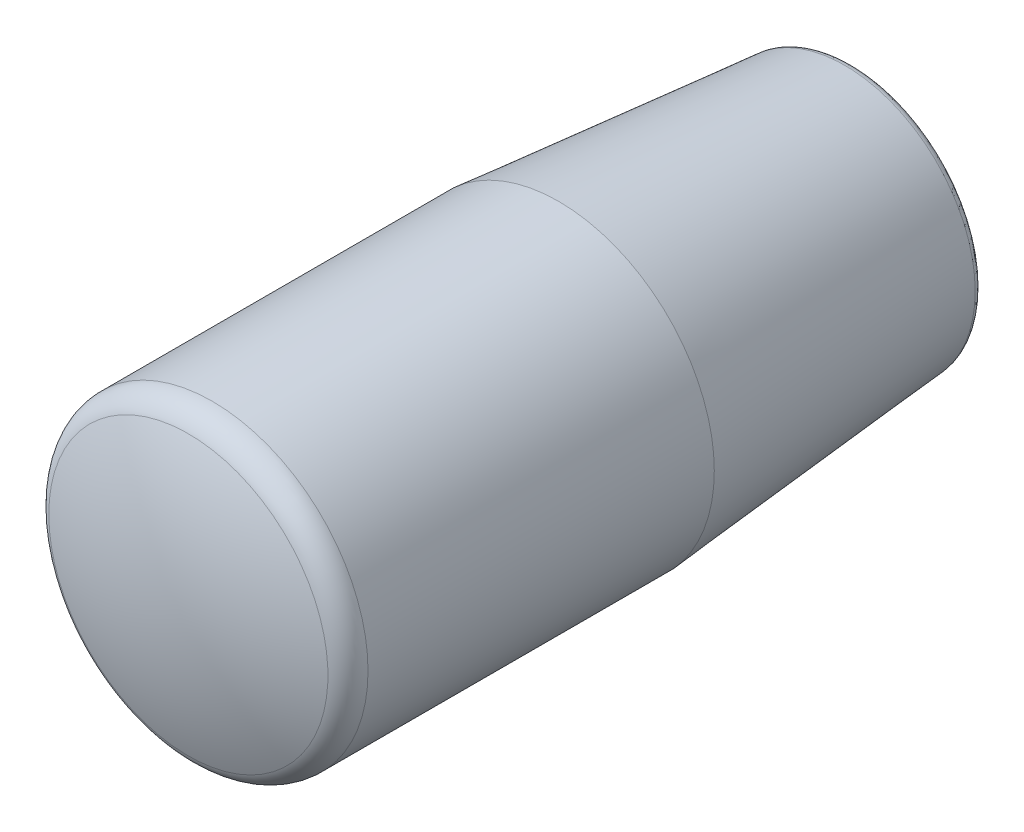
ISO-10303-21;
HEADER;
FILE_DESCRIPTION(('STEP AP214'),'2;1');
FILE_NAME('part.step','',(''),(''),'','','');
FILE_SCHEMA(('AUTOMOTIVE_DESIGN { 1 0 10303 214 1 1 1 1 }'));
ENDSEC;
DATA;
#1=APPLICATION_CONTEXT('core data for automotive mechanical design processes');
#2=APPLICATION_PROTOCOL_DEFINITION('international standard','automotive_design',2000,#1);
#3=PRODUCT_CONTEXT('',#1,'mechanical');
#4=PRODUCT('Part','Part','',(#3));
#5=PRODUCT_RELATED_PRODUCT_CATEGORY('part','',(#4));
#6=PRODUCT_DEFINITION_FORMATION('','',#4);
#7=PRODUCT_DEFINITION_CONTEXT('part definition',#1,'design');
#8=PRODUCT_DEFINITION('design','',#6,#7);
#9=PRODUCT_DEFINITION_SHAPE('','',#8);
#10=(LENGTH_UNIT() NAMED_UNIT(*) SI_UNIT(.MILLI.,.METRE.));
#11=(NAMED_UNIT(*) PLANE_ANGLE_UNIT() SI_UNIT($,.RADIAN.));
#12=(NAMED_UNIT(*) SI_UNIT($,.STERADIAN.) SOLID_ANGLE_UNIT());
#13=UNCERTAINTY_MEASURE_WITH_UNIT(LENGTH_MEASURE(1.E-05),#10,'distance_accuracy_value','');
#14=(GEOMETRIC_REPRESENTATION_CONTEXT(3) GLOBAL_UNCERTAINTY_ASSIGNED_CONTEXT((#13)) GLOBAL_UNIT_ASSIGNED_CONTEXT((#10,
#11,#12)) REPRESENTATION_CONTEXT('',''));
#15=CARTESIAN_POINT('',(0.,0.,0.));
#16=DIRECTION('',(0.,0.,1.));
#17=DIRECTION('',(1.,0.,0.));
#18=AXIS2_PLACEMENT_3D('',#15,#16,#17);
#19=CARTESIAN_POINT('',(0.,0.,0.5));
#20=DIRECTION('',(0.,0.,-1.));
#21=DIRECTION('',(-1.,0.,0.));
#22=AXIS2_PLACEMENT_3D('',#19,#20,#21);
#23=TOROIDAL_SURFACE('',#22,7.04217505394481,0.5);
#24=CARTESIAN_POINT('',(0.,0.,0.));
#25=DIRECTION('',(0.,0.,-1.));
#26=DIRECTION('',(-1.,0.,0.));
#27=AXIS2_PLACEMENT_3D('',#24,#25,#26);
#28=CIRCLE('',#27,7.04217505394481);
#29=CARTESIAN_POINT('',(-7.04217505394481,0.,0.));
#30=VERTEX_POINT('',#29);
#31=EDGE_CURVE('E8',#30,#30,#28,.T.);
#32=ORIENTED_EDGE('',*,*,#31,.F.);
#33=EDGE_LOOP('',(#32));
#34=FACE_BOUND('',#33,.T.);
#35=CARTESIAN_POINT('',(0.,0.,0.4560530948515));
#36=DIRECTION('',(0.,0.,-1.));
#37=DIRECTION('',(-1.,0.,0.));
#38=AXIS2_PLACEMENT_3D('',#35,#36,#37);
#39=CIRCLE('',#38,7.5402399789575);
#40=CARTESIAN_POINT('',(-7.5402399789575,0.,0.4560530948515));
#41=VERTEX_POINT('',#40);
#42=EDGE_CURVE('E37',#41,#41,#39,.T.);
#43=ORIENTED_EDGE('',*,*,#42,.T.);
#44=EDGE_LOOP('',(#43));
#45=FACE_BOUND('',#44,.T.);
#46=ADVANCED_FACE('F12',(#34,#45),#23,.T.);
#47=CARTESIAN_POINT('',(0.,4.,0.));
#48=DIRECTION('',(0.,0.,-1.));
#49=DIRECTION('',(-1.,0.,0.));
#50=AXIS2_PLACEMENT_3D('',#47,#48,#49);
#51=PLANE('',#50);
#52=ORIENTED_EDGE('',*,*,#31,.T.);
#53=EDGE_LOOP('',(#52));
#54=FACE_BOUND('',#53,.T.);
#55=CARTESIAN_POINT('',(0.,0.,0.));
#56=DIRECTION('',(0.,0.,-1.));
#57=DIRECTION('',(-1.,0.,0.));
#58=AXIS2_PLACEMENT_3D('',#55,#56,#57);
#59=CIRCLE('',#58,4.);
#60=CARTESIAN_POINT('',(-4.,0.,0.));
#61=VERTEX_POINT('',#60);
#62=EDGE_CURVE('E18',#61,#61,#59,.T.);
#63=ORIENTED_EDGE('',*,*,#62,.F.);
#64=EDGE_LOOP('',(#63));
#65=FACE_BOUND('',#64,.T.);
#66=ADVANCED_FACE('F56',(#54,#65),#51,.T.);
#67=CARTESIAN_POINT('',(0.,0.,-5.));
#68=DIRECTION('',(0.,0.,-1.));
#69=DIRECTION('',(-1.,0.,0.));
#70=AXIS2_PLACEMENT_3D('',#67,#68,#69);
#71=CYLINDRICAL_SURFACE('',#70,4.);
#72=CARTESIAN_POINT('',(0.,0.,28.));
#73=DIRECTION('',(0.,0.,-1.));
#74=DIRECTION('',(-1.,0.,0.));
#75=AXIS2_PLACEMENT_3D('',#72,#73,#74);
#76=CIRCLE('',#75,4.);
#77=CARTESIAN_POINT('',(-4.,0.,28.));
#78=VERTEX_POINT('',#77);
#79=EDGE_CURVE('E22',#78,#78,#76,.T.);
#80=ORIENTED_EDGE('',*,*,#79,.F.);
#81=EDGE_LOOP('',(#80));
#82=FACE_BOUND('',#81,.T.);
#83=ORIENTED_EDGE('',*,*,#62,.T.);
#84=EDGE_LOOP('',(#83));
#85=FACE_BOUND('',#84,.T.);
#86=ADVANCED_FACE('F62',(#82,#85),#71,.F.);
#87=CARTESIAN_POINT('',(0.,4.,28.));
#88=DIRECTION('',(0.,0.,1.));
#89=DIRECTION('',(1.,0.,0.));
#90=AXIS2_PLACEMENT_3D('',#87,#88,#89);
#91=PLANE('',#90);
#92=ORIENTED_EDGE('',*,*,#79,.T.);
#93=EDGE_LOOP('',(#92));
#94=FACE_BOUND('',#93,.T.);
#95=ADVANCED_FACE('F67',(#94),#91,.F.);
#96=CARTESIAN_POINT('',(0.,0.,18.75));
#97=DIRECTION('',(-1.,0.,0.));
#98=DIRECTION('',(0.,0.,1.));
#99=AXIS2_PLACEMENT_3D('',#96,#97,#98);
#100=SPHERICAL_SURFACE('',#99,21.25);
#101=CARTESIAN_POINT('',(0.,0.,18.75));
#102=DIRECTION('',(0.,0.,-1.));
#103=DIRECTION('',(-1.,0.,0.));
#104=AXIS2_PLACEMENT_3D('',#101,#102,#103);
#105=SPHERICAL_SURFACE('',#104,21.25);
#106=CARTESIAN_POINT('',(0.,0.,38.408172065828));
#107=DIRECTION('',(0.,0.,-1.));
#108=DIRECTION('',(-1.,0.,0.));
#109=AXIS2_PLACEMENT_3D('',#106,#107,#108);
#110=CIRCLE('',#109,8.06962025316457);
#111=CARTESIAN_POINT('',(-8.06962025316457,0.,38.408172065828));
#112=VERTEX_POINT('',#111);
#113=EDGE_CURVE('E26',#112,#112,#110,.T.);
#114=ORIENTED_EDGE('',*,*,#113,.F.);
#115=EDGE_LOOP('',(#114));
#116=FACE_BOUND('',#115,.T.);
#117=ADVANCED_FACE('F74',(#116),#105,.T.);
#118=CARTESIAN_POINT('',(0.,0.,37.020536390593));
#119=DIRECTION('',(0.,0.,-1.));
#120=DIRECTION('',(-1.,0.,0.));
#121=AXIS2_PLACEMENT_3D('',#118,#119,#120);
#122=TOROIDAL_SURFACE('',#121,7.5,1.50000000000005);
#123=CARTESIAN_POINT('',(0.,0.,37.020536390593));
#124=DIRECTION('',(0.,0.,-1.));
#125=DIRECTION('',(-1.,0.,0.));
#126=AXIS2_PLACEMENT_3D('',#123,#124,#125);
#127=CIRCLE('',#126,9.);
#128=CARTESIAN_POINT('',(-9.,0.,37.020536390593));
#129=VERTEX_POINT('',#128);
#130=EDGE_CURVE('E31',#129,#129,#127,.T.);
#131=ORIENTED_EDGE('',*,*,#130,.F.);
#132=EDGE_LOOP('',(#131));
#133=FACE_BOUND('',#132,.T.);
#134=ORIENTED_EDGE('',*,*,#113,.T.);
#135=EDGE_LOOP('',(#134));
#136=FACE_BOUND('',#135,.T.);
#137=ADVANCED_FACE('F52',(#133,#136),#122,.T.);
#138=CARTESIAN_POINT('',(0.,0.,-5.));
#139=DIRECTION('',(0.,0.,-1.));
#140=DIRECTION('',(-1.,0.,0.));
#141=AXIS2_PLACEMENT_3D('',#138,#139,#140);
#142=CYLINDRICAL_SURFACE('',#141,9.);
#143=ORIENTED_EDGE('',*,*,#130,.T.);
#144=EDGE_LOOP('',(#143));
#145=FACE_BOUND('',#144,.T.);
#146=CARTESIAN_POINT('',(0.,0.,17.));
#147=DIRECTION('',(0.,0.,-1.));
#148=DIRECTION('',(-1.,0.,0.));
#149=AXIS2_PLACEMENT_3D('',#146,#147,#148);
#150=CIRCLE('',#149,9.);
#151=CARTESIAN_POINT('',(-9.,0.,17.));
#152=VERTEX_POINT('',#151);
#153=EDGE_CURVE('E34',#152,#152,#150,.T.);
#154=ORIENTED_EDGE('',*,*,#153,.F.);
#155=EDGE_LOOP('',(#154));
#156=FACE_BOUND('',#155,.T.);
#157=ADVANCED_FACE('F44',(#145,#156),#142,.T.);
#158=CARTESIAN_POINT('',(0.,0.,0.4560530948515));
#159=DIRECTION('',(0.,0.,1.));
#160=DIRECTION('',(1.,0.,0.));
#161=AXIS2_PLACEMENT_3D('',#158,#159,#160);
#162=CONICAL_SURFACE('',#161,7.5402399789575,0.0880073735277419);
#163=ORIENTED_EDGE('',*,*,#153,.T.);
#164=EDGE_LOOP('',(#163));
#165=FACE_BOUND('',#164,.T.);
#166=ORIENTED_EDGE('',*,*,#42,.F.);
#167=EDGE_LOOP('',(#166));
#168=FACE_BOUND('',#167,.T.);
#169=ADVANCED_FACE('F42',(#165,#168),#162,.T.);
#170=CLOSED_SHELL('',(#46,#66,#86,#95,#117,#137,#157,#169));
#171=MANIFOLD_SOLID_BREP('B1',#170);
#172=ADVANCED_BREP_SHAPE_REPRESENTATION('',(#18,#171),#14);
#173=SHAPE_DEFINITION_REPRESENTATION(#9,#172);
ENDSEC;
END-ISO-10303-21;
